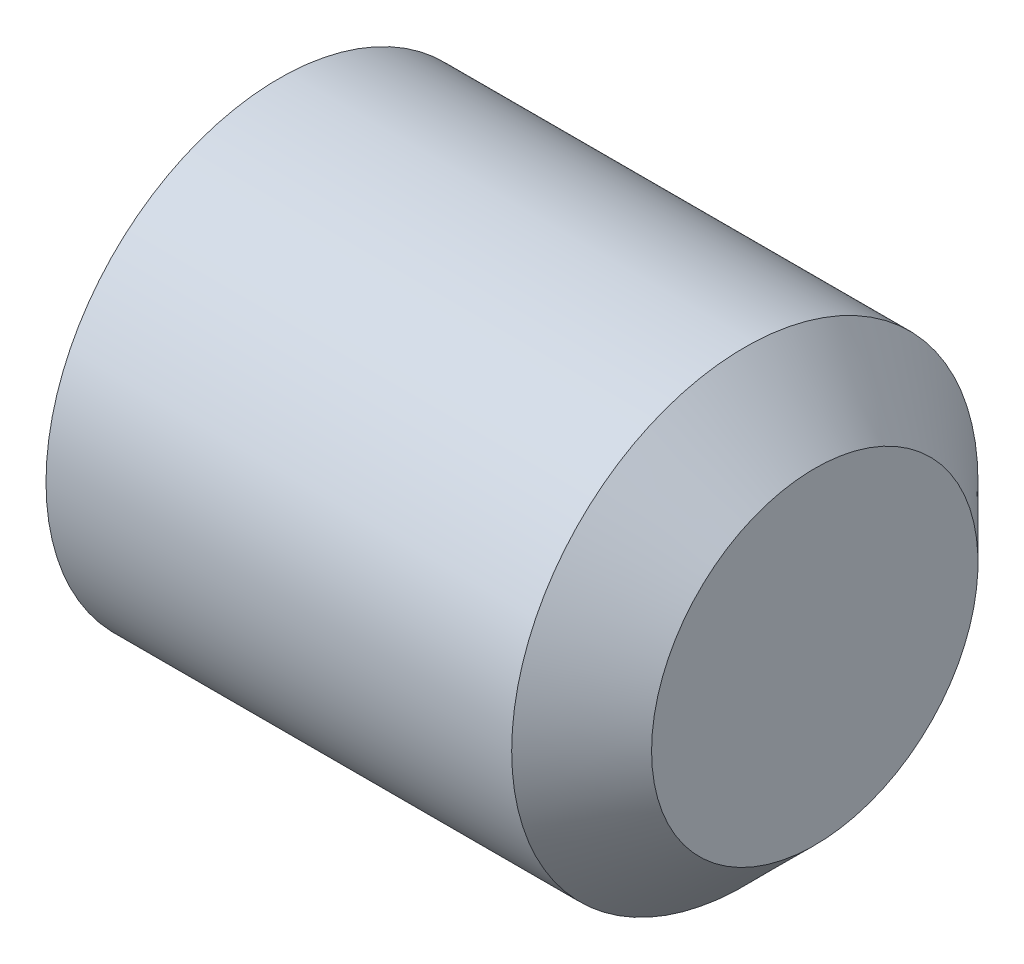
ISO-10303-21;
HEADER;
FILE_DESCRIPTION(('STEP AP214'),'2;1');
FILE_NAME('part.step','',(''),(''),'','','');
FILE_SCHEMA(('AUTOMOTIVE_DESIGN { 1 0 10303 214 1 1 1 1 }'));
ENDSEC;
DATA;
#1=APPLICATION_CONTEXT('core data for automotive mechanical design processes');
#2=APPLICATION_PROTOCOL_DEFINITION('international standard','automotive_design',2000,#1);
#3=PRODUCT_CONTEXT('',#1,'mechanical');
#4=PRODUCT('Part','Part','',(#3));
#5=PRODUCT_RELATED_PRODUCT_CATEGORY('part','',(#4));
#6=PRODUCT_DEFINITION_FORMATION('','',#4);
#7=PRODUCT_DEFINITION_CONTEXT('part definition',#1,'design');
#8=PRODUCT_DEFINITION('design','',#6,#7);
#9=PRODUCT_DEFINITION_SHAPE('','',#8);
#10=(LENGTH_UNIT() NAMED_UNIT(*) SI_UNIT(.MILLI.,.METRE.));
#11=(NAMED_UNIT(*) PLANE_ANGLE_UNIT() SI_UNIT($,.RADIAN.));
#12=(NAMED_UNIT(*) SI_UNIT($,.STERADIAN.) SOLID_ANGLE_UNIT());
#13=UNCERTAINTY_MEASURE_WITH_UNIT(LENGTH_MEASURE(1.E-05),#10,'distance_accuracy_value','');
#14=(GEOMETRIC_REPRESENTATION_CONTEXT(3) GLOBAL_UNCERTAINTY_ASSIGNED_CONTEXT((#13)) GLOBAL_UNIT_ASSIGNED_CONTEXT((#10,
#11,#12)) REPRESENTATION_CONTEXT('',''));
#15=CARTESIAN_POINT('',(0.,0.,0.));
#16=DIRECTION('',(0.,0.,1.));
#17=DIRECTION('',(1.,0.,0.));
#18=AXIS2_PLACEMENT_3D('',#15,#16,#17);
#19=CARTESIAN_POINT('',(0.,0.,0.));
#20=DIRECTION('',(-1.,0.,0.));
#21=DIRECTION('',(0.,0.,1.));
#22=AXIS2_PLACEMENT_3D('',#19,#20,#21);
#23=PLANE('',#22);
#24=CARTESIAN_POINT('',(0.,0.,0.));
#25=DIRECTION('',(-1.,0.,0.));
#26=DIRECTION('',(0.,0.,1.));
#27=AXIS2_PLACEMENT_3D('',#24,#25,#26);
#28=CIRCLE('',#27,2.055);
#29=CARTESIAN_POINT('',(0.,0.,2.055));
#30=VERTEX_POINT('',#29);
#31=EDGE_CURVE('E160',#30,#30,#28,.T.);
#32=ORIENTED_EDGE('',*,*,#31,.T.);
#33=EDGE_LOOP('',(#32));
#34=FACE_BOUND('',#33,.T.);
#35=DIRECTION('',(0.,0.,-1.));
#36=VECTOR('',#35,1.);
#37=CARTESIAN_POINT('',(0.,1.25,0.72168783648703));
#38=LINE('',#37,#36);
#39=CARTESIAN_POINT('',(0.,1.25,0.72168783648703));
#40=VERTEX_POINT('',#39);
#41=CARTESIAN_POINT('',(0.,1.25,-0.721687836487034));
#42=VERTEX_POINT('',#41);
#43=EDGE_CURVE('E145',#40,#42,#38,.T.);
#44=ORIENTED_EDGE('',*,*,#43,.F.);
#45=DIRECTION('',(0.,-0.866025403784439,0.5));
#46=VECTOR('',#45,1.);
#47=CARTESIAN_POINT('',(0.,1.25,0.72168783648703));
#48=LINE('',#47,#46);
#49=CARTESIAN_POINT('',(0.,0.,1.44337567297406));
#50=VERTEX_POINT('',#49);
#51=EDGE_CURVE('E58',#40,#50,#48,.T.);
#52=ORIENTED_EDGE('',*,*,#51,.T.);
#53=DIRECTION('',(0.,0.866025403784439,0.5));
#54=VECTOR('',#53,1.);
#55=CARTESIAN_POINT('',(0.,-1.25,0.72168783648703));
#56=LINE('',#55,#54);
#57=CARTESIAN_POINT('',(0.,-1.25,0.72168783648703));
#58=VERTEX_POINT('',#57);
#59=EDGE_CURVE('E132',#58,#50,#56,.T.);
#60=ORIENTED_EDGE('',*,*,#59,.F.);
#61=DIRECTION('',(0.,0.,-1.));
#62=VECTOR('',#61,1.);
#63=CARTESIAN_POINT('',(0.,-1.25,0.72168783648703));
#64=LINE('',#63,#62);
#65=CARTESIAN_POINT('',(0.,-1.25,-0.721687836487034));
#66=VERTEX_POINT('',#65);
#67=EDGE_CURVE('E136',#58,#66,#64,.T.);
#68=ORIENTED_EDGE('',*,*,#67,.T.);
#69=DIRECTION('',(0.,0.866025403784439,-0.5));
#70=VECTOR('',#69,1.);
#71=CARTESIAN_POINT('',(0.,-1.25,-0.721687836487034));
#72=LINE('',#71,#70);
#73=CARTESIAN_POINT('',(0.,0.,-1.44337567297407));
#74=VERTEX_POINT('',#73);
#75=EDGE_CURVE('E140',#66,#74,#72,.T.);
#76=ORIENTED_EDGE('',*,*,#75,.T.);
#77=DIRECTION('',(0.,-0.866025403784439,-0.5));
#78=VECTOR('',#77,1.);
#79=CARTESIAN_POINT('',(0.,1.25,-0.721687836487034));
#80=LINE('',#79,#78);
#81=EDGE_CURVE('E117',#42,#74,#80,.T.);
#82=ORIENTED_EDGE('',*,*,#81,.F.);
#83=EDGE_LOOP('',(#44,#52,#60,#68,#76,#82));
#84=FACE_BOUND('',#83,.T.);
#85=ADVANCED_FACE('F42',(#34,#84),#23,.T.);
#86=CARTESIAN_POINT('',(6.,1.75,0.));
#87=DIRECTION('',(1.,0.,0.));
#88=DIRECTION('',(0.,0.,-1.));
#89=AXIS2_PLACEMENT_3D('',#86,#87,#88);
#90=PLANE('',#89);
#91=CARTESIAN_POINT('',(6.,0.,0.));
#92=DIRECTION('',(-1.,0.,0.));
#93=DIRECTION('',(0.,0.,1.));
#94=AXIS2_PLACEMENT_3D('',#91,#92,#93);
#95=CIRCLE('',#94,1.75);
#96=CARTESIAN_POINT('',(6.,0.,1.75));
#97=VERTEX_POINT('',#96);
#98=EDGE_CURVE('E11',#97,#97,#95,.T.);
#99=ORIENTED_EDGE('',*,*,#98,.F.);
#100=EDGE_LOOP('',(#99));
#101=FACE_BOUND('',#100,.T.);
#102=ADVANCED_FACE('F44',(#101),#90,.T.);
#103=CARTESIAN_POINT('',(5.25,0.,0.));
#104=DIRECTION('',(-1.,0.,0.));
#105=DIRECTION('',(0.,0.,1.));
#106=AXIS2_PLACEMENT_3D('',#103,#104,#105);
#107=CONICAL_SURFACE('',#106,2.5,0.785398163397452);
#108=ORIENTED_EDGE('',*,*,#98,.T.);
#109=EDGE_LOOP('',(#108));
#110=FACE_BOUND('',#109,.T.);
#111=CARTESIAN_POINT('',(5.25,0.,0.));
#112=DIRECTION('',(-1.,0.,0.));
#113=DIRECTION('',(0.,0.,1.));
#114=AXIS2_PLACEMENT_3D('',#111,#112,#113);
#115=CIRCLE('',#114,2.5);
#116=CARTESIAN_POINT('',(5.25,0.,2.5));
#117=VERTEX_POINT('',#116);
#118=EDGE_CURVE('E51',#117,#117,#115,.T.);
#119=ORIENTED_EDGE('',*,*,#118,.F.);
#120=EDGE_LOOP('',(#119));
#121=FACE_BOUND('',#120,.T.);
#122=ADVANCED_FACE('F174',(#110,#121),#107,.T.);
#123=CARTESIAN_POINT('',(-12.7,0.,0.));
#124=DIRECTION('',(-1.,0.,0.));
#125=DIRECTION('',(0.,0.,1.));
#126=AXIS2_PLACEMENT_3D('',#123,#124,#125);
#127=CYLINDRICAL_SURFACE('',#126,2.5);
#128=ORIENTED_EDGE('',*,*,#118,.T.);
#129=EDGE_LOOP('',(#128));
#130=FACE_BOUND('',#129,.T.);
#131=CARTESIAN_POINT('',(0.256920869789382,0.,0.));
#132=DIRECTION('',(-1.,0.,0.));
#133=DIRECTION('',(0.,0.,1.));
#134=AXIS2_PLACEMENT_3D('',#131,#132,#133);
#135=CIRCLE('',#134,2.5);
#136=CARTESIAN_POINT('',(0.256920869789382,0.,2.5));
#137=VERTEX_POINT('',#136);
#138=EDGE_CURVE('E164',#137,#137,#135,.T.);
#139=ORIENTED_EDGE('',*,*,#138,.F.);
#140=EDGE_LOOP('',(#139));
#141=FACE_BOUND('',#140,.T.);
#142=ADVANCED_FACE('F171',(#130,#141),#127,.T.);
#143=CARTESIAN_POINT('',(0.,0.,0.));
#144=DIRECTION('',(1.,0.,0.));
#145=DIRECTION('',(0.,0.,-1.));
#146=AXIS2_PLACEMENT_3D('',#143,#144,#145);
#147=CONICAL_SURFACE('',#146,2.055,1.0471975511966);
#148=ORIENTED_EDGE('',*,*,#138,.T.);
#149=EDGE_LOOP('',(#148));
#150=FACE_BOUND('',#149,.T.);
#151=ORIENTED_EDGE('',*,*,#31,.F.);
#152=EDGE_LOOP('',(#151));
#153=FACE_BOUND('',#152,.T.);
#154=ADVANCED_FACE('F181',(#150,#153),#147,.T.);
#155=CARTESIAN_POINT('',(2.,1.25,0.72168783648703));
#156=DIRECTION('',(0.,-0.5,-0.866025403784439));
#157=DIRECTION('',(0.,0.866025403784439,-0.5));
#158=AXIS2_PLACEMENT_3D('',#155,#156,#157);
#159=PLANE('',#158);
#160=ORIENTED_EDGE('',*,*,#51,.F.);
#161=DIRECTION('',(-1.,0.,0.));
#162=VECTOR('',#161,1.);
#163=CARTESIAN_POINT('',(2.,1.25,0.72168783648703));
#164=LINE('',#163,#162);
#165=CARTESIAN_POINT('',(2.,1.25,0.72168783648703));
#166=VERTEX_POINT('',#165);
#167=EDGE_CURVE('E63',#166,#40,#164,.T.);
#168=ORIENTED_EDGE('',*,*,#167,.F.);
#169=DIRECTION('',(0.,-0.866025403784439,0.5));
#170=VECTOR('',#169,1.);
#171=CARTESIAN_POINT('',(2.,1.25,0.72168783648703));
#172=LINE('',#171,#170);
#173=CARTESIAN_POINT('',(2.,0.,1.44337567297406));
#174=VERTEX_POINT('',#173);
#175=EDGE_CURVE('E90',#166,#174,#172,.T.);
#176=ORIENTED_EDGE('',*,*,#175,.T.);
#177=DIRECTION('',(-1.,0.,0.));
#178=VECTOR('',#177,1.);
#179=CARTESIAN_POINT('',(2.,0.,1.44337567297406));
#180=LINE('',#179,#178);
#181=EDGE_CURVE('E157',#174,#50,#180,.T.);
#182=ORIENTED_EDGE('',*,*,#181,.T.);
#183=EDGE_LOOP('',(#160,#168,#176,#182));
#184=FACE_BOUND('',#183,.T.);
#185=ADVANCED_FACE('F192',(#184),#159,.T.);
#186=CARTESIAN_POINT('',(2.,-1.25,0.72168783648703));
#187=DIRECTION('',(0.,-0.5,0.866025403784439));
#188=DIRECTION('',(0.,-0.866025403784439,-0.5));
#189=AXIS2_PLACEMENT_3D('',#186,#187,#188);
#190=PLANE('',#189);
#191=ORIENTED_EDGE('',*,*,#59,.T.);
#192=ORIENTED_EDGE('',*,*,#181,.F.);
#193=DIRECTION('',(0.,0.866025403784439,0.5));
#194=VECTOR('',#193,1.);
#195=CARTESIAN_POINT('',(2.,-1.25,0.72168783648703));
#196=LINE('',#195,#194);
#197=CARTESIAN_POINT('',(2.,-1.25,0.72168783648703));
#198=VERTEX_POINT('',#197);
#199=EDGE_CURVE('E293',#198,#174,#196,.T.);
#200=ORIENTED_EDGE('',*,*,#199,.F.);
#201=DIRECTION('',(-1.,0.,0.));
#202=VECTOR('',#201,1.);
#203=CARTESIAN_POINT('',(2.,-1.25,0.72168783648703));
#204=LINE('',#203,#202);
#205=EDGE_CURVE('E154',#198,#58,#204,.T.);
#206=ORIENTED_EDGE('',*,*,#205,.T.);
#207=EDGE_LOOP('',(#191,#192,#200,#206));
#208=FACE_BOUND('',#207,.T.);
#209=ADVANCED_FACE('F199',(#208),#190,.F.);
#210=CARTESIAN_POINT('',(2.,-1.25,0.72168783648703));
#211=DIRECTION('',(0.,1.,0.));
#212=DIRECTION('',(0.,0.,1.));
#213=AXIS2_PLACEMENT_3D('',#210,#211,#212);
#214=PLANE('',#213);
#215=ORIENTED_EDGE('',*,*,#67,.F.);
#216=ORIENTED_EDGE('',*,*,#205,.F.);
#217=DIRECTION('',(0.,0.,-1.));
#218=VECTOR('',#217,1.);
#219=CARTESIAN_POINT('',(2.,-1.25,0.72168783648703));
#220=LINE('',#219,#218);
#221=CARTESIAN_POINT('',(2.,-1.25,-0.721687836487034));
#222=VERTEX_POINT('',#221);
#223=EDGE_CURVE('E112',#198,#222,#220,.T.);
#224=ORIENTED_EDGE('',*,*,#223,.T.);
#225=DIRECTION('',(-1.,0.,0.));
#226=VECTOR('',#225,1.);
#227=CARTESIAN_POINT('',(2.,-1.25,-0.721687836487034));
#228=LINE('',#227,#226);
#229=EDGE_CURVE('E106',#222,#66,#228,.T.);
#230=ORIENTED_EDGE('',*,*,#229,.T.);
#231=EDGE_LOOP('',(#215,#216,#224,#230));
#232=FACE_BOUND('',#231,.T.);
#233=ADVANCED_FACE('F206',(#232),#214,.T.);
#234=CARTESIAN_POINT('',(2.,-1.25,-0.721687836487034));
#235=DIRECTION('',(0.,0.5,0.866025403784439));
#236=DIRECTION('',(0.,-0.866025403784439,0.5));
#237=AXIS2_PLACEMENT_3D('',#234,#235,#236);
#238=PLANE('',#237);
#239=ORIENTED_EDGE('',*,*,#75,.F.);
#240=ORIENTED_EDGE('',*,*,#229,.F.);
#241=DIRECTION('',(0.,0.866025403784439,-0.5));
#242=VECTOR('',#241,1.);
#243=CARTESIAN_POINT('',(2.,-1.25,-0.721687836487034));
#244=LINE('',#243,#242);
#245=CARTESIAN_POINT('',(2.,0.,-1.44337567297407));
#246=VERTEX_POINT('',#245);
#247=EDGE_CURVE('E101',#222,#246,#244,.T.);
#248=ORIENTED_EDGE('',*,*,#247,.T.);
#249=DIRECTION('',(-1.,0.,0.));
#250=VECTOR('',#249,1.);
#251=CARTESIAN_POINT('',(2.,0.,-1.44337567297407));
#252=LINE('',#251,#250);
#253=EDGE_CURVE('E105',#246,#74,#252,.T.);
#254=ORIENTED_EDGE('',*,*,#253,.T.);
#255=EDGE_LOOP('',(#239,#240,#248,#254));
#256=FACE_BOUND('',#255,.T.);
#257=ADVANCED_FACE('F104',(#256),#238,.T.);
#258=CARTESIAN_POINT('',(2.,1.25,-0.721687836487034));
#259=DIRECTION('',(0.,0.5,-0.866025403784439));
#260=DIRECTION('',(0.,0.866025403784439,0.5));
#261=AXIS2_PLACEMENT_3D('',#258,#259,#260);
#262=PLANE('',#261);
#263=ORIENTED_EDGE('',*,*,#81,.T.);
#264=ORIENTED_EDGE('',*,*,#253,.F.);
#265=DIRECTION('',(0.,-0.866025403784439,-0.5));
#266=VECTOR('',#265,1.);
#267=CARTESIAN_POINT('',(2.,1.25,-0.721687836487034));
#268=LINE('',#267,#266);
#269=CARTESIAN_POINT('',(2.,1.25,-0.721687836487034));
#270=VERTEX_POINT('',#269);
#271=EDGE_CURVE('E111',#270,#246,#268,.T.);
#272=ORIENTED_EDGE('',*,*,#271,.F.);
#273=DIRECTION('',(-1.,0.,0.));
#274=VECTOR('',#273,1.);
#275=CARTESIAN_POINT('',(2.,1.25,-0.721687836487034));
#276=LINE('',#275,#274);
#277=EDGE_CURVE('E86',#270,#42,#276,.T.);
#278=ORIENTED_EDGE('',*,*,#277,.T.);
#279=EDGE_LOOP('',(#263,#264,#272,#278));
#280=FACE_BOUND('',#279,.T.);
#281=ADVANCED_FACE('F114',(#280),#262,.F.);
#282=CARTESIAN_POINT('',(2.,1.25,0.72168783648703));
#283=DIRECTION('',(0.,1.,0.));
#284=DIRECTION('',(0.,0.,1.));
#285=AXIS2_PLACEMENT_3D('',#282,#283,#284);
#286=PLANE('',#285);
#287=ORIENTED_EDGE('',*,*,#43,.T.);
#288=ORIENTED_EDGE('',*,*,#277,.F.);
#289=DIRECTION('',(0.,0.,-1.));
#290=VECTOR('',#289,1.);
#291=CARTESIAN_POINT('',(2.,1.25,0.72168783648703));
#292=LINE('',#291,#290);
#293=EDGE_CURVE('E123',#166,#270,#292,.T.);
#294=ORIENTED_EDGE('',*,*,#293,.F.);
#295=ORIENTED_EDGE('',*,*,#167,.T.);
#296=EDGE_LOOP('',(#287,#288,#294,#295));
#297=FACE_BOUND('',#296,.T.);
#298=ADVANCED_FACE('F218',(#297),#286,.F.);
#299=CARTESIAN_POINT('',(2.,-1.25,2.16506350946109));
#300=DIRECTION('',(1.,0.,0.));
#301=DIRECTION('',(0.,0.,-1.));
#302=AXIS2_PLACEMENT_3D('',#299,#300,#301);
#303=PLANE('',#302);
#304=ORIENTED_EDGE('',*,*,#175,.F.);
#305=ORIENTED_EDGE('',*,*,#293,.T.);
#306=ORIENTED_EDGE('',*,*,#271,.T.);
#307=ORIENTED_EDGE('',*,*,#247,.F.);
#308=ORIENTED_EDGE('',*,*,#223,.F.);
#309=ORIENTED_EDGE('',*,*,#199,.T.);
#310=EDGE_LOOP('',(#304,#305,#306,#307,#308,#309));
#311=FACE_BOUND('',#310,.T.);
#312=ADVANCED_FACE('F121',(#311),#303,.F.);
#313=CLOSED_SHELL('',(#85,#102,#122,#142,#154,#185,#209,#233,#257,#281,#298,#312));
#314=MANIFOLD_SOLID_BREP('B2',#313);
#315=ADVANCED_BREP_SHAPE_REPRESENTATION('',(#18,#314),#14);
#316=SHAPE_DEFINITION_REPRESENTATION(#9,#315);
ENDSEC;
END-ISO-10303-21;
